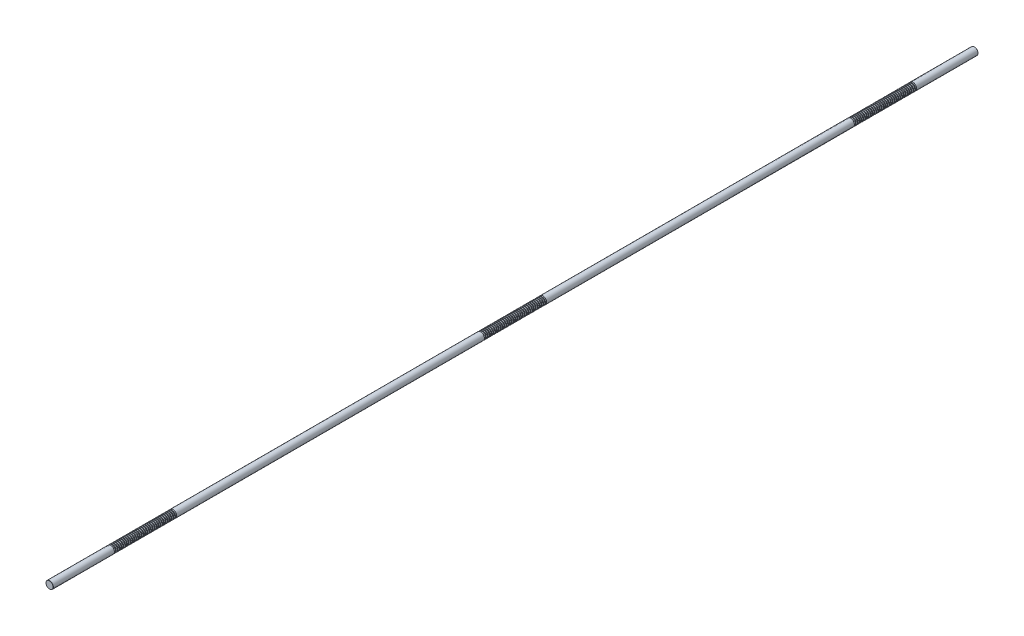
from build123d import *

# Parameters (mm, degrees)
SKETCH1_R           = 6
BOSS_EXTRUDE1_DEPTH = 750
CHAMFER1_SIZE       = 0.3
LPATTERN1_COUNT     = 34
LPATTERN1_PITCH     = 3
LPATTERN2_COUNT     = 3
LPATTERN2_PITCH     = 600


with BuildPart() as part:
    # Sketch1 → Boss-Extrude1 (new, symmetric)
    with BuildSketch(Plane.XY):
        Circle(SKETCH1_R)
    extrude(amount=BOSS_EXTRUDE1_DEPTH, both=True)

    # Chamfer1
    chamfer1_edges = [part.edges().sort_by_distance(p)[0] for p in [
        (-6, 0, -750),
        (-6, 0, 750),
    ]]
    chamfer(chamfer1_edges, length=CHAMFER1_SIZE)

    # Sketch2 → Cut-Revolve1 (revolve, cut)
    with BuildSketch(Plane(origin=(0, 0, 0), x_dir=(0, 0, -1), z_dir=(1, 0, 0)), mode=Mode.PRIVATE) as cut_revolve1_sk:
        Polygon((650.234455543, 6), (648.265544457, 6), (648.734455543, 4.25), (649.765544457, 4.25), align=None)
    cut_revolve1 = revolve(cut_revolve1_sk.sketch.rotate(Axis((0, 0, 750), (0, 0, -1)), 90), axis=Axis((0, 0, 750), (0, 0, -1)), mode=Mode.SUBTRACT)

    # LPattern1: Cut-Revolve1 ×34
    with Locations(*[(0, 0, i * LPATTERN1_PITCH) for i in range(1, LPATTERN1_COUNT)]):
        add(cut_revolve1, mode=Mode.SUBTRACT)

    # LPattern2: Cut-Revolve1 ×3
    with Locations(*[(0, 0, i * LPATTERN2_PITCH) for i in range(1, LPATTERN2_COUNT)]):
        add(cut_revolve1, mode=Mode.SUBTRACT)

    # LPattern2 copy 1 sketch → LPattern2 copy 1 (revolve, cut)
    with BuildSketch(Plane(origin=(0, 0, 603), x_dir=(0, 0, -1), z_dir=(1, 0, 0))):
        Polygon((650.234455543, 6), (648.265544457, 6), (648.734455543, 4.25), (649.765544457, 4.25), align=None)
    revolve(axis=Axis((0, 0, 1353), (0, 0, -1)), mode=Mode.SUBTRACT)

    # LPattern2 copy 2 sketch → LPattern2 copy 2 (revolve, cut)
    with BuildSketch(Plane(origin=(0, 0, 1203), x_dir=(0, 0, -1), z_dir=(1, 0, 0))):
        Polygon((650.234455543, 6), (648.265544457, 6), (648.734455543, 4.25), (649.765544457, 4.25), align=None)
    revolve(axis=Axis((0, 0, 1953), (0, 0, -1)), mode=Mode.SUBTRACT)

    # LPattern2 copy 3 sketch → LPattern2 copy 3 (revolve, cut)
    with BuildSketch(Plane(origin=(0, 0, 606), x_dir=(0, 0, -1), z_dir=(1, 0, 0))):
        Polygon((650.234455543, 6), (648.265544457, 6), (648.734455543, 4.25), (649.765544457, 4.25), align=None)
    revolve(axis=Axis((0, 0, 1356), (0, 0, -1)), mode=Mode.SUBTRACT)

    # LPattern2 copy 4 sketch → LPattern2 copy 4 (revolve, cut)
    with BuildSketch(Plane(origin=(0, 0, 1206), x_dir=(0, 0, -1), z_dir=(1, 0, 0))):
        Polygon((650.234455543, 6), (648.265544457, 6), (648.734455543, 4.25), (649.765544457, 4.25), align=None)
    revolve(axis=Axis((0, 0, 1956), (0, 0, -1)), mode=Mode.SUBTRACT)

    # LPattern2 copy 5 sketch → LPattern2 copy 5 (revolve, cut)
    with BuildSketch(Plane(origin=(0, 0, 609), x_dir=(0, 0, -1), z_dir=(1, 0, 0))):
        Polygon((650.234455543, 6), (648.265544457, 6), (648.734455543, 4.25), (649.765544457, 4.25), align=None)
    revolve(axis=Axis((0, 0, 1359), (0, 0, -1)), mode=Mode.SUBTRACT)

    # LPattern2 copy 6 sketch → LPattern2 copy 6 (revolve, cut)
    with BuildSketch(Plane(origin=(0, 0, 1209), x_dir=(0, 0, -1), z_dir=(1, 0, 0))):
        Polygon((650.234455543, 6), (648.265544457, 6), (648.734455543, 4.25), (649.765544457, 4.25), align=None)
    revolve(axis=Axis((0, 0, 1959), (0, 0, -1)), mode=Mode.SUBTRACT)

    # LPattern2 copy 7 sketch → LPattern2 copy 7 (revolve, cut)
    with BuildSketch(Plane(origin=(0, 0, 612), x_dir=(0, 0, -1), z_dir=(1, 0, 0))):
        Polygon((650.234455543, 6), (648.265544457, 6), (648.734455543, 4.25), (649.765544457, 4.25), align=None)
    revolve(axis=Axis((0, 0, 1362), (0, 0, -1)), mode=Mode.SUBTRACT)

    # LPattern2 copy 8 sketch → LPattern2 copy 8 (revolve, cut)
    with BuildSketch(Plane(origin=(0, 0, 1212), x_dir=(0, 0, -1), z_dir=(1, 0, 0))):
        Polygon((650.234455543, 6), (648.265544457, 6), (648.734455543, 4.25), (649.765544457, 4.25), align=None)
    revolve(axis=Axis((0, 0, 1962), (0, 0, -1)), mode=Mode.SUBTRACT)

    # LPattern2 copy 9 sketch → LPattern2 copy 9 (revolve, cut)
    with BuildSketch(Plane(origin=(0, 0, 615), x_dir=(0, 0, -1), z_dir=(1, 0, 0))):
        Polygon((650.234455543, 6), (648.265544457, 6), (648.734455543, 4.25), (649.765544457, 4.25), align=None)
    revolve(axis=Axis((0, 0, 1365), (0, 0, -1)), mode=Mode.SUBTRACT)

    # LPattern2 copy 10 sketch → LPattern2 copy 10 (revolve, cut)
    with BuildSketch(Plane(origin=(0, 0, 1215), x_dir=(0, 0, -1), z_dir=(1, 0, 0))):
        Polygon((650.234455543, 6), (648.265544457, 6), (648.734455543, 4.25), (649.765544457, 4.25), align=None)
    revolve(axis=Axis((0, 0, 1965), (0, 0, -1)), mode=Mode.SUBTRACT)

    # LPattern2 copy 11 sketch → LPattern2 copy 11 (revolve, cut)
    with BuildSketch(Plane(origin=(0, 0, 618), x_dir=(0, 0, -1), z_dir=(1, 0, 0))):
        Polygon((650.234455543, 6), (648.265544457, 6), (648.734455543, 4.25), (649.765544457, 4.25), align=None)
    revolve(axis=Axis((0, 0, 1368), (0, 0, -1)), mode=Mode.SUBTRACT)

    # LPattern2 copy 12 sketch → LPattern2 copy 12 (revolve, cut)
    with BuildSketch(Plane(origin=(0, 0, 1218), x_dir=(0, 0, -1), z_dir=(1, 0, 0))):
        Polygon((650.234455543, 6), (648.265544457, 6), (648.734455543, 4.25), (649.765544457, 4.25), align=None)
    revolve(axis=Axis((0, 0, 1968), (0, 0, -1)), mode=Mode.SUBTRACT)

    # LPattern2 copy 13 sketch → LPattern2 copy 13 (revolve, cut)
    with BuildSketch(Plane(origin=(0, 0, 621), x_dir=(0, 0, -1), z_dir=(1, 0, 0))):
        Polygon((650.234455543, 6), (648.265544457, 6), (648.734455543, 4.25), (649.765544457, 4.25), align=None)
    revolve(axis=Axis((0, 0, 1371), (0, 0, -1)), mode=Mode.SUBTRACT)

    # LPattern2 copy 14 sketch → LPattern2 copy 14 (revolve, cut)
    with BuildSketch(Plane(origin=(0, 0, 1221), x_dir=(0, 0, -1), z_dir=(1, 0, 0))):
        Polygon((650.234455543, 6), (648.265544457, 6), (648.734455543, 4.25), (649.765544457, 4.25), align=None)
    revolve(axis=Axis((0, 0, 1971), (0, 0, -1)), mode=Mode.SUBTRACT)

    # LPattern2 copy 15 sketch → LPattern2 copy 15 (revolve, cut)
    with BuildSketch(Plane(origin=(0, 0, 624), x_dir=(0, 0, -1), z_dir=(1, 0, 0))):
        Polygon((650.234455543, 6), (648.265544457, 6), (648.734455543, 4.25), (649.765544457, 4.25), align=None)
    revolve(axis=Axis((0, 0, 1374), (0, 0, -1)), mode=Mode.SUBTRACT)

    # LPattern2 copy 16 sketch → LPattern2 copy 16 (revolve, cut)
    with BuildSketch(Plane(origin=(0, 0, 1224), x_dir=(0, 0, -1), z_dir=(1, 0, 0))):
        Polygon((650.234455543, 6), (648.265544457, 6), (648.734455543, 4.25), (649.765544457, 4.25), align=None)
    revolve(axis=Axis((0, 0, 1974), (0, 0, -1)), mode=Mode.SUBTRACT)

    # LPattern2 copy 17 sketch → LPattern2 copy 17 (revolve, cut)
    with BuildSketch(Plane(origin=(0, 0, 627), x_dir=(0, 0, -1), z_dir=(1, 0, 0))):
        Polygon((650.234455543, 6), (648.265544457, 6), (648.734455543, 4.25), (649.765544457, 4.25), align=None)
    revolve(axis=Axis((0, 0, 1377), (0, 0, -1)), mode=Mode.SUBTRACT)

    # LPattern2 copy 18 sketch → LPattern2 copy 18 (revolve, cut)
    with BuildSketch(Plane(origin=(0, 0, 1227), x_dir=(0, 0, -1), z_dir=(1, 0, 0))):
        Polygon((650.234455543, 6), (648.265544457, 6), (648.734455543, 4.25), (649.765544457, 4.25), align=None)
    revolve(axis=Axis((0, 0, 1977), (0, 0, -1)), mode=Mode.SUBTRACT)

    # LPattern2 copy 19 sketch → LPattern2 copy 19 (revolve, cut)
    with BuildSketch(Plane(origin=(0, 0, 630), x_dir=(0, 0, -1), z_dir=(1, 0, 0))):
        Polygon((650.234455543, 6), (648.265544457, 6), (648.734455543, 4.25), (649.765544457, 4.25), align=None)
    revolve(axis=Axis((0, 0, 1380), (0, 0, -1)), mode=Mode.SUBTRACT)

    # LPattern2 copy 20 sketch → LPattern2 copy 20 (revolve, cut)
    with BuildSketch(Plane(origin=(0, 0, 1230), x_dir=(0, 0, -1), z_dir=(1, 0, 0))):
        Polygon((650.234455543, 6), (648.265544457, 6), (648.734455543, 4.25), (649.765544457, 4.25), align=None)
    revolve(axis=Axis((0, 0, 1980), (0, 0, -1)), mode=Mode.SUBTRACT)

    # LPattern2 copy 21 sketch → LPattern2 copy 21 (revolve, cut)
    with BuildSketch(Plane(origin=(0, 0, 633), x_dir=(0, 0, -1), z_dir=(1, 0, 0))):
        Polygon((650.234455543, 6), (648.265544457, 6), (648.734455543, 4.25), (649.765544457, 4.25), align=None)
    revolve(axis=Axis((0, 0, 1383), (0, 0, -1)), mode=Mode.SUBTRACT)

    # LPattern2 copy 22 sketch → LPattern2 copy 22 (revolve, cut)
    with BuildSketch(Plane(origin=(0, 0, 1233), x_dir=(0, 0, -1), z_dir=(1, 0, 0))):
        Polygon((650.234455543, 6), (648.265544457, 6), (648.734455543, 4.25), (649.765544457, 4.25), align=None)
    revolve(axis=Axis((0, 0, 1983), (0, 0, -1)), mode=Mode.SUBTRACT)

    # LPattern2 copy 23 sketch → LPattern2 copy 23 (revolve, cut)
    with BuildSketch(Plane(origin=(0, 0, 636), x_dir=(0, 0, -1), z_dir=(1, 0, 0))):
        Polygon((650.234455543, 6), (648.265544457, 6), (648.734455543, 4.25), (649.765544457, 4.25), align=None)
    revolve(axis=Axis((0, 0, 1386), (0, 0, -1)), mode=Mode.SUBTRACT)

    # LPattern2 copy 24 sketch → LPattern2 copy 24 (revolve, cut)
    with BuildSketch(Plane(origin=(0, 0, 1236), x_dir=(0, 0, -1), z_dir=(1, 0, 0))):
        Polygon((650.234455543, 6), (648.265544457, 6), (648.734455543, 4.25), (649.765544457, 4.25), align=None)
    revolve(axis=Axis((0, 0, 1986), (0, 0, -1)), mode=Mode.SUBTRACT)

    # LPattern2 copy 25 sketch → LPattern2 copy 25 (revolve, cut)
    with BuildSketch(Plane(origin=(0, 0, 639), x_dir=(0, 0, -1), z_dir=(1, 0, 0))):
        Polygon((650.234455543, 6), (648.265544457, 6), (648.734455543, 4.25), (649.765544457, 4.25), align=None)
    revolve(axis=Axis((0, 0, 1389), (0, 0, -1)), mode=Mode.SUBTRACT)

    # LPattern2 copy 26 sketch → LPattern2 copy 26 (revolve, cut)
    with BuildSketch(Plane(origin=(0, 0, 1239), x_dir=(0, 0, -1), z_dir=(1, 0, 0))):
        Polygon((650.234455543, 6), (648.265544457, 6), (648.734455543, 4.25), (649.765544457, 4.25), align=None)
    revolve(axis=Axis((0, 0, 1989), (0, 0, -1)), mode=Mode.SUBTRACT)

    # LPattern2 copy 27 sketch → LPattern2 copy 27 (revolve, cut)
    with BuildSketch(Plane(origin=(0, 0, 642), x_dir=(0, 0, -1), z_dir=(1, 0, 0))):
        Polygon((650.234455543, 6), (648.265544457, 6), (648.734455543, 4.25), (649.765544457, 4.25), align=None)
    revolve(axis=Axis((0, 0, 1392), (0, 0, -1)), mode=Mode.SUBTRACT)

    # LPattern2 copy 28 sketch → LPattern2 copy 28 (revolve, cut)
    with BuildSketch(Plane(origin=(0, 0, 1242), x_dir=(0, 0, -1), z_dir=(1, 0, 0))):
        Polygon((650.234455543, 6), (648.265544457, 6), (648.734455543, 4.25), (649.765544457, 4.25), align=None)
    revolve(axis=Axis((0, 0, 1992), (0, 0, -1)), mode=Mode.SUBTRACT)

    # LPattern2 copy 29 sketch → LPattern2 copy 29 (revolve, cut)
    with BuildSketch(Plane(origin=(0, 0, 645), x_dir=(0, 0, -1), z_dir=(1, 0, 0))):
        Polygon((650.234455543, 6), (648.265544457, 6), (648.734455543, 4.25), (649.765544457, 4.25), align=None)
    revolve(axis=Axis((0, 0, 1395), (0, 0, -1)), mode=Mode.SUBTRACT)

    # LPattern2 copy 30 sketch → LPattern2 copy 30 (revolve, cut)
    with BuildSketch(Plane(origin=(0, 0, 1245), x_dir=(0, 0, -1), z_dir=(1, 0, 0))):
        Polygon((650.234455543, 6), (648.265544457, 6), (648.734455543, 4.25), (649.765544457, 4.25), align=None)
    revolve(axis=Axis((0, 0, 1995), (0, 0, -1)), mode=Mode.SUBTRACT)

    # LPattern2 copy 31 sketch → LPattern2 copy 31 (revolve, cut)
    with BuildSketch(Plane(origin=(0, 0, 648), x_dir=(0, 0, -1), z_dir=(1, 0, 0))):
        Polygon((650.234455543, 6), (648.265544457, 6), (648.734455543, 4.25), (649.765544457, 4.25), align=None)
    revolve(axis=Axis((0, 0, 1398), (0, 0, -1)), mode=Mode.SUBTRACT)

    # LPattern2 copy 32 sketch → LPattern2 copy 32 (revolve, cut)
    with BuildSketch(Plane(origin=(0, 0, 1248), x_dir=(0, 0, -1), z_dir=(1, 0, 0))):
        Polygon((650.234455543, 6), (648.265544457, 6), (648.734455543, 4.25), (649.765544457, 4.25), align=None)
    revolve(axis=Axis((0, 0, 1998), (0, 0, -1)), mode=Mode.SUBTRACT)

    # LPattern2 copy 33 sketch → LPattern2 copy 33 (revolve, cut)
    with BuildSketch(Plane(origin=(0, 0, 651), x_dir=(0, 0, -1), z_dir=(1, 0, 0))):
        Polygon((650.234455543, 6), (648.265544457, 6), (648.734455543, 4.25), (649.765544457, 4.25), align=None)
    revolve(axis=Axis((0, 0, 1401), (0, 0, -1)), mode=Mode.SUBTRACT)

    # LPattern2 copy 34 sketch → LPattern2 copy 34 (revolve, cut)
    with BuildSketch(Plane(origin=(0, 0, 1251), x_dir=(0, 0, -1), z_dir=(1, 0, 0))):
        Polygon((650.234455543, 6), (648.265544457, 6), (648.734455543, 4.25), (649.765544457, 4.25), align=None)
    revolve(axis=Axis((0, 0, 2001), (0, 0, -1)), mode=Mode.SUBTRACT)

    # LPattern2 copy 35 sketch → LPattern2 copy 35 (revolve, cut)
    with BuildSketch(Plane(origin=(0, 0, 654), x_dir=(0, 0, -1), z_dir=(1, 0, 0))):
        Polygon((650.234455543, 6), (648.265544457, 6), (648.734455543, 4.25), (649.765544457, 4.25), align=None)
    revolve(axis=Axis((0, 0, 1404), (0, 0, -1)), mode=Mode.SUBTRACT)

    # LPattern2 copy 36 sketch → LPattern2 copy 36 (revolve, cut)
    with BuildSketch(Plane(origin=(0, 0, 1254), x_dir=(0, 0, -1), z_dir=(1, 0, 0))):
        Polygon((650.234455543, 6), (648.265544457, 6), (648.734455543, 4.25), (649.765544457, 4.25), align=None)
    revolve(axis=Axis((0, 0, 2004), (0, 0, -1)), mode=Mode.SUBTRACT)

    # LPattern2 copy 37 sketch → LPattern2 copy 37 (revolve, cut)
    with BuildSketch(Plane(origin=(0, 0, 657), x_dir=(0, 0, -1), z_dir=(1, 0, 0))):
        Polygon((650.234455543, 6), (648.265544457, 6), (648.734455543, 4.25), (649.765544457, 4.25), align=None)
    revolve(axis=Axis((0, 0, 1407), (0, 0, -1)), mode=Mode.SUBTRACT)

    # LPattern2 copy 38 sketch → LPattern2 copy 38 (revolve, cut)
    with BuildSketch(Plane(origin=(0, 0, 1257), x_dir=(0, 0, -1), z_dir=(1, 0, 0))):
        Polygon((650.234455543, 6), (648.265544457, 6), (648.734455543, 4.25), (649.765544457, 4.25), align=None)
    revolve(axis=Axis((0, 0, 2007), (0, 0, -1)), mode=Mode.SUBTRACT)

    # LPattern2 copy 39 sketch → LPattern2 copy 39 (revolve, cut)
    with BuildSketch(Plane(origin=(0, 0, 660), x_dir=(0, 0, -1), z_dir=(1, 0, 0))):
        Polygon((650.234455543, 6), (648.265544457, 6), (648.734455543, 4.25), (649.765544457, 4.25), align=None)
    revolve(axis=Axis((0, 0, 1410), (0, 0, -1)), mode=Mode.SUBTRACT)

    # LPattern2 copy 40 sketch → LPattern2 copy 40 (revolve, cut)
    with BuildSketch(Plane(origin=(0, 0, 1260), x_dir=(0, 0, -1), z_dir=(1, 0, 0))):
        Polygon((650.234455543, 6), (648.265544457, 6), (648.734455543, 4.25), (649.765544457, 4.25), align=None)
    revolve(axis=Axis((0, 0, 2010), (0, 0, -1)), mode=Mode.SUBTRACT)

    # LPattern2 copy 41 sketch → LPattern2 copy 41 (revolve, cut)
    with BuildSketch(Plane(origin=(0, 0, 663), x_dir=(0, 0, -1), z_dir=(1, 0, 0))):
        Polygon((650.234455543, 6), (648.265544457, 6), (648.734455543, 4.25), (649.765544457, 4.25), align=None)
    revolve(axis=Axis((0, 0, 1413), (0, 0, -1)), mode=Mode.SUBTRACT)

    # LPattern2 copy 42 sketch → LPattern2 copy 42 (revolve, cut)
    with BuildSketch(Plane(origin=(0, 0, 1263), x_dir=(0, 0, -1), z_dir=(1, 0, 0))):
        Polygon((650.234455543, 6), (648.265544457, 6), (648.734455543, 4.25), (649.765544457, 4.25), align=None)
    revolve(axis=Axis((0, 0, 2013), (0, 0, -1)), mode=Mode.SUBTRACT)

    # LPattern2 copy 43 sketch → LPattern2 copy 43 (revolve, cut)
    with BuildSketch(Plane(origin=(0, 0, 666), x_dir=(0, 0, -1), z_dir=(1, 0, 0))):
        Polygon((650.234455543, 6), (648.265544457, 6), (648.734455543, 4.25), (649.765544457, 4.25), align=None)
    revolve(axis=Axis((0, 0, 1416), (0, 0, -1)), mode=Mode.SUBTRACT)

    # LPattern2 copy 44 sketch → LPattern2 copy 44 (revolve, cut)
    with BuildSketch(Plane(origin=(0, 0, 1266), x_dir=(0, 0, -1), z_dir=(1, 0, 0))):
        Polygon((650.234455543, 6), (648.265544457, 6), (648.734455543, 4.25), (649.765544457, 4.25), align=None)
    revolve(axis=Axis((0, 0, 2016), (0, 0, -1)), mode=Mode.SUBTRACT)

    # LPattern2 copy 45 sketch → LPattern2 copy 45 (revolve, cut)
    with BuildSketch(Plane(origin=(0, 0, 669), x_dir=(0, 0, -1), z_dir=(1, 0, 0))):
        Polygon((650.234455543, 6), (648.265544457, 6), (648.734455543, 4.25), (649.765544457, 4.25), align=None)
    revolve(axis=Axis((0, 0, 1419), (0, 0, -1)), mode=Mode.SUBTRACT)

    # LPattern2 copy 46 sketch → LPattern2 copy 46 (revolve, cut)
    with BuildSketch(Plane(origin=(0, 0, 1269), x_dir=(0, 0, -1), z_dir=(1, 0, 0))):
        Polygon((650.234455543, 6), (648.265544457, 6), (648.734455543, 4.25), (649.765544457, 4.25), align=None)
    revolve(axis=Axis((0, 0, 2019), (0, 0, -1)), mode=Mode.SUBTRACT)

    # LPattern2 copy 47 sketch → LPattern2 copy 47 (revolve, cut)
    with BuildSketch(Plane(origin=(0, 0, 672), x_dir=(0, 0, -1), z_dir=(1, 0, 0))):
        Polygon((650.234455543, 6), (648.265544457, 6), (648.734455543, 4.25), (649.765544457, 4.25), align=None)
    revolve(axis=Axis((0, 0, 1422), (0, 0, -1)), mode=Mode.SUBTRACT)

    # LPattern2 copy 48 sketch → LPattern2 copy 48 (revolve, cut)
    with BuildSketch(Plane(origin=(0, 0, 1272), x_dir=(0, 0, -1), z_dir=(1, 0, 0))):
        Polygon((650.234455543, 6), (648.265544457, 6), (648.734455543, 4.25), (649.765544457, 4.25), align=None)
    revolve(axis=Axis((0, 0, 2022), (0, 0, -1)), mode=Mode.SUBTRACT)

    # LPattern2 copy 49 sketch → LPattern2 copy 49 (revolve, cut)
    with BuildSketch(Plane(origin=(0, 0, 675), x_dir=(0, 0, -1), z_dir=(1, 0, 0))):
        Polygon((650.234455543, 6), (648.265544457, 6), (648.734455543, 4.25), (649.765544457, 4.25), align=None)
    revolve(axis=Axis((0, 0, 1425), (0, 0, -1)), mode=Mode.SUBTRACT)

    # LPattern2 copy 50 sketch → LPattern2 copy 50 (revolve, cut)
    with BuildSketch(Plane(origin=(0, 0, 1275), x_dir=(0, 0, -1), z_dir=(1, 0, 0))):
        Polygon((650.234455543, 6), (648.265544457, 6), (648.734455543, 4.25), (649.765544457, 4.25), align=None)
    revolve(axis=Axis((0, 0, 2025), (0, 0, -1)), mode=Mode.SUBTRACT)

    # LPattern2 copy 51 sketch → LPattern2 copy 51 (revolve, cut)
    with BuildSketch(Plane(origin=(0, 0, 678), x_dir=(0, 0, -1), z_dir=(1, 0, 0))):
        Polygon((650.234455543, 6), (648.265544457, 6), (648.734455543, 4.25), (649.765544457, 4.25), align=None)
    revolve(axis=Axis((0, 0, 1428), (0, 0, -1)), mode=Mode.SUBTRACT)

    # LPattern2 copy 52 sketch → LPattern2 copy 52 (revolve, cut)
    with BuildSketch(Plane(origin=(0, 0, 1278), x_dir=(0, 0, -1), z_dir=(1, 0, 0))):
        Polygon((650.234455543, 6), (648.265544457, 6), (648.734455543, 4.25), (649.765544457, 4.25), align=None)
    revolve(axis=Axis((0, 0, 2028), (0, 0, -1)), mode=Mode.SUBTRACT)

    # LPattern2 copy 53 sketch → LPattern2 copy 53 (revolve, cut)
    with BuildSketch(Plane(origin=(0, 0, 681), x_dir=(0, 0, -1), z_dir=(1, 0, 0))):
        Polygon((650.234455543, 6), (648.265544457, 6), (648.734455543, 4.25), (649.765544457, 4.25), align=None)
    revolve(axis=Axis((0, 0, 1431), (0, 0, -1)), mode=Mode.SUBTRACT)

    # LPattern2 copy 54 sketch → LPattern2 copy 54 (revolve, cut)
    with BuildSketch(Plane(origin=(0, 0, 1281), x_dir=(0, 0, -1), z_dir=(1, 0, 0))):
        Polygon((650.234455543, 6), (648.265544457, 6), (648.734455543, 4.25), (649.765544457, 4.25), align=None)
    revolve(axis=Axis((0, 0, 2031), (0, 0, -1)), mode=Mode.SUBTRACT)

    # LPattern2 copy 55 sketch → LPattern2 copy 55 (revolve, cut)
    with BuildSketch(Plane(origin=(0, 0, 684), x_dir=(0, 0, -1), z_dir=(1, 0, 0))):
        Polygon((650.234455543, 6), (648.265544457, 6), (648.734455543, 4.25), (649.765544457, 4.25), align=None)
    revolve(axis=Axis((0, 0, 1434), (0, 0, -1)), mode=Mode.SUBTRACT)

    # LPattern2 copy 56 sketch → LPattern2 copy 56 (revolve, cut)
    with BuildSketch(Plane(origin=(0, 0, 1284), x_dir=(0, 0, -1), z_dir=(1, 0, 0))):
        Polygon((650.234455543, 6), (648.265544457, 6), (648.734455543, 4.25), (649.765544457, 4.25), align=None)
    revolve(axis=Axis((0, 0, 2034), (0, 0, -1)), mode=Mode.SUBTRACT)

    # LPattern2 copy 57 sketch → LPattern2 copy 57 (revolve, cut)
    with BuildSketch(Plane(origin=(0, 0, 687), x_dir=(0, 0, -1), z_dir=(1, 0, 0))):
        Polygon((650.234455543, 6), (648.265544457, 6), (648.734455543, 4.25), (649.765544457, 4.25), align=None)
    revolve(axis=Axis((0, 0, 1437), (0, 0, -1)), mode=Mode.SUBTRACT)

    # LPattern2 copy 58 sketch → LPattern2 copy 58 (revolve, cut)
    with BuildSketch(Plane(origin=(0, 0, 1287), x_dir=(0, 0, -1), z_dir=(1, 0, 0))):
        Polygon((650.234455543, 6), (648.265544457, 6), (648.734455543, 4.25), (649.765544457, 4.25), align=None)
    revolve(axis=Axis((0, 0, 2037), (0, 0, -1)), mode=Mode.SUBTRACT)

    # LPattern2 copy 59 sketch → LPattern2 copy 59 (revolve, cut)
    with BuildSketch(Plane(origin=(0, 0, 690), x_dir=(0, 0, -1), z_dir=(1, 0, 0))):
        Polygon((650.234455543, 6), (648.265544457, 6), (648.734455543, 4.25), (649.765544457, 4.25), align=None)
    revolve(axis=Axis((0, 0, 1440), (0, 0, -1)), mode=Mode.SUBTRACT)

    # LPattern2 copy 60 sketch → LPattern2 copy 60 (revolve, cut)
    with BuildSketch(Plane(origin=(0, 0, 1290), x_dir=(0, 0, -1), z_dir=(1, 0, 0))):
        Polygon((650.234455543, 6), (648.265544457, 6), (648.734455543, 4.25), (649.765544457, 4.25), align=None)
    revolve(axis=Axis((0, 0, 2040), (0, 0, -1)), mode=Mode.SUBTRACT)

    # LPattern2 copy 61 sketch → LPattern2 copy 61 (revolve, cut)
    with BuildSketch(Plane(origin=(0, 0, 693), x_dir=(0, 0, -1), z_dir=(1, 0, 0))):
        Polygon((650.234455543, 6), (648.265544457, 6), (648.734455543, 4.25), (649.765544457, 4.25), align=None)
    revolve(axis=Axis((0, 0, 1443), (0, 0, -1)), mode=Mode.SUBTRACT)

    # LPattern2 copy 62 sketch → LPattern2 copy 62 (revolve, cut)
    with BuildSketch(Plane(origin=(0, 0, 1293), x_dir=(0, 0, -1), z_dir=(1, 0, 0))):
        Polygon((650.234455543, 6), (648.265544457, 6), (648.734455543, 4.25), (649.765544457, 4.25), align=None)
    revolve(axis=Axis((0, 0, 2043), (0, 0, -1)), mode=Mode.SUBTRACT)

    # LPattern2 copy 63 sketch → LPattern2 copy 63 (revolve, cut)
    with BuildSketch(Plane(origin=(0, 0, 696), x_dir=(0, 0, -1), z_dir=(1, 0, 0))):
        Polygon((650.234455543, 6), (648.265544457, 6), (648.734455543, 4.25), (649.765544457, 4.25), align=None)
    revolve(axis=Axis((0, 0, 1446), (0, 0, -1)), mode=Mode.SUBTRACT)

    # LPattern2 copy 64 sketch → LPattern2 copy 64 (revolve, cut)
    with BuildSketch(Plane(origin=(0, 0, 1296), x_dir=(0, 0, -1), z_dir=(1, 0, 0))):
        Polygon((650.234455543, 6), (648.265544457, 6), (648.734455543, 4.25), (649.765544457, 4.25), align=None)
    revolve(axis=Axis((0, 0, 2046), (0, 0, -1)), mode=Mode.SUBTRACT)

    # LPattern2 copy 65 sketch → LPattern2 copy 65 (revolve, cut)
    with BuildSketch(Plane(origin=(0, 0, 699), x_dir=(0, 0, -1), z_dir=(1, 0, 0))):
        Polygon((650.234455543, 6), (648.265544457, 6), (648.734455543, 4.25), (649.765544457, 4.25), align=None)
    revolve(axis=Axis((0, 0, 1449), (0, 0, -1)), mode=Mode.SUBTRACT)

    # LPattern2 copy 66 sketch → LPattern2 copy 66 (revolve, cut)
    with BuildSketch(Plane(origin=(0, 0, 1299), x_dir=(0, 0, -1), z_dir=(1, 0, 0))):
        Polygon((650.234455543, 6), (648.265544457, 6), (648.734455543, 4.25), (649.765544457, 4.25), align=None)
    revolve(axis=Axis((0, 0, 2049), (0, 0, -1)), mode=Mode.SUBTRACT)


solid = part.part
